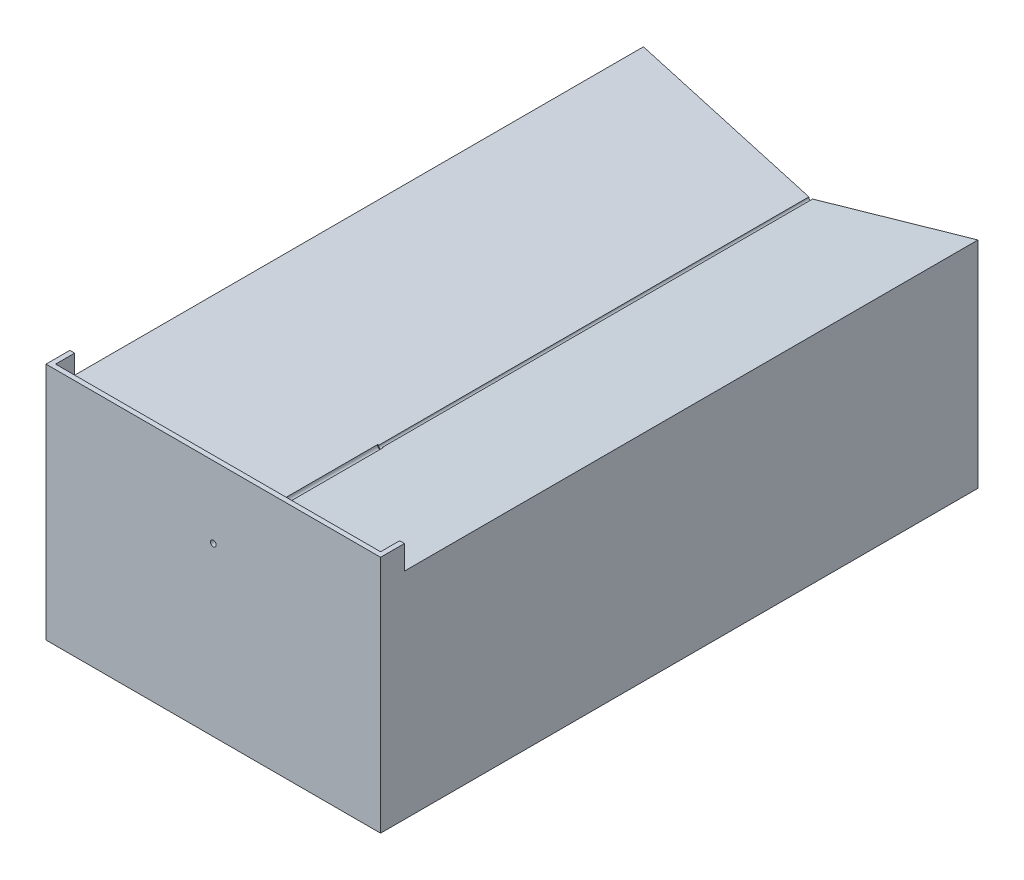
ISO-10303-21;
HEADER;
FILE_DESCRIPTION(('STEP AP214'),'2;1');
FILE_NAME('part.step','',(''),(''),'','','');
FILE_SCHEMA(('AUTOMOTIVE_DESIGN { 1 0 10303 214 1 1 1 1 }'));
ENDSEC;
DATA;
#1=APPLICATION_CONTEXT('core data for automotive mechanical design processes');
#2=APPLICATION_PROTOCOL_DEFINITION('international standard','automotive_design',2000,#1);
#3=PRODUCT_CONTEXT('',#1,'mechanical');
#4=PRODUCT('Part','Part','',(#3));
#5=PRODUCT_RELATED_PRODUCT_CATEGORY('part','',(#4));
#6=PRODUCT_DEFINITION_FORMATION('','',#4);
#7=PRODUCT_DEFINITION_CONTEXT('part definition',#1,'design');
#8=PRODUCT_DEFINITION('design','',#6,#7);
#9=PRODUCT_DEFINITION_SHAPE('','',#8);
#10=(LENGTH_UNIT() NAMED_UNIT(*) SI_UNIT(.MILLI.,.METRE.));
#11=(NAMED_UNIT(*) PLANE_ANGLE_UNIT() SI_UNIT($,.RADIAN.));
#12=(NAMED_UNIT(*) SI_UNIT($,.STERADIAN.) SOLID_ANGLE_UNIT());
#13=UNCERTAINTY_MEASURE_WITH_UNIT(LENGTH_MEASURE(1.E-05),#10,'distance_accuracy_value','');
#14=(GEOMETRIC_REPRESENTATION_CONTEXT(3) GLOBAL_UNCERTAINTY_ASSIGNED_CONTEXT((#13)) GLOBAL_UNIT_ASSIGNED_CONTEXT((#10,
#11,#12)) REPRESENTATION_CONTEXT('',''));
#15=CARTESIAN_POINT('',(0.,0.,0.));
#16=DIRECTION('',(0.,0.,1.));
#17=DIRECTION('',(1.,0.,0.));
#18=AXIS2_PLACEMENT_3D('',#15,#16,#17);
#19=CARTESIAN_POINT('',(0.,12.5,120.));
#20=DIRECTION('',(0.,0.,-1.));
#21=DIRECTION('',(-1.,0.,0.));
#22=AXIS2_PLACEMENT_3D('',#19,#20,#21);
#23=CYLINDRICAL_SURFACE('',#22,0.399999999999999);
#24=CARTESIAN_POINT('',(0.,12.5,90.));
#25=DIRECTION('',(0.,0.,1.));
#26=DIRECTION('',(1.,0.,0.));
#27=AXIS2_PLACEMENT_3D('',#24,#25,#26);
#28=CIRCLE('',#27,0.399999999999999);
#29=CARTESIAN_POINT('',(0.384609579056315,12.6098884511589,90.));
#30=VERTEX_POINT('',#29);
#31=CARTESIAN_POINT('',(-0.384609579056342,12.6098884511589,90.));
#32=VERTEX_POINT('',#31);
#33=EDGE_CURVE('E11',#30,#32,#28,.F.);
#34=ORIENTED_EDGE('',*,*,#33,.F.);
#35=DIRECTION('',(0.,0.,-1.));
#36=VECTOR('',#35,1.);
#37=CARTESIAN_POINT('',(0.384609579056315,12.6098884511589,120.));
#38=LINE('',#37,#36);
#39=CARTESIAN_POINT('',(0.384609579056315,12.6098884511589,0.));
#40=VERTEX_POINT('',#39);
#41=EDGE_CURVE('E159',#30,#40,#38,.T.);
#42=ORIENTED_EDGE('',*,*,#41,.T.);
#43=CARTESIAN_POINT('',(0.,12.5,0.));
#44=DIRECTION('',(0.,0.,-1.));
#45=DIRECTION('',(1.,0.,0.));
#46=AXIS2_PLACEMENT_3D('',#43,#44,#45);
#47=CIRCLE('',#46,0.399999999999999);
#48=CARTESIAN_POINT('',(-0.384609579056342,12.6098884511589,0.));
#49=VERTEX_POINT('',#48);
#50=EDGE_CURVE('E239',#40,#49,#47,.T.);
#51=ORIENTED_EDGE('',*,*,#50,.T.);
#52=DIRECTION('',(0.,0.,-1.));
#53=VECTOR('',#52,1.);
#54=CARTESIAN_POINT('',(-0.384609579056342,12.6098884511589,120.));
#55=LINE('',#54,#53);
#56=EDGE_CURVE('E228',#32,#49,#55,.T.);
#57=ORIENTED_EDGE('',*,*,#56,.F.);
#58=EDGE_LOOP('',(#34,#42,#51,#57));
#59=FACE_BOUND('',#58,.T.);
#60=ADVANCED_FACE('F33',(#59),#23,.F.);
#61=CARTESIAN_POINT('',(0.,0.,120.));
#62=DIRECTION('',(0.,0.,-1.));
#63=DIRECTION('',(-1.,0.,0.));
#64=AXIS2_PLACEMENT_3D('',#61,#62,#63);
#65=PLANE('',#64);
#66=DIRECTION('',(0.,1.,0.));
#67=VECTOR('',#66,1.);
#68=CARTESIAN_POINT('',(-34.,-20.5,120.));
#69=LINE('',#68,#67);
#70=CARTESIAN_POINT('',(-34.,22.2142857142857,120.));
#71=VERTEX_POINT('',#70);
#72=CARTESIAN_POINT('',(-34.,27.5,120.));
#73=VERTEX_POINT('',#72);
#74=EDGE_CURVE('E187',#71,#73,#69,.T.);
#75=ORIENTED_EDGE('',*,*,#74,.F.);
#76=DIRECTION('',(-0.961523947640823,0.274721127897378,0.));
#77=VECTOR('',#76,1.);
#78=CARTESIAN_POINT('',(-35.,22.5,120.));
#79=LINE('',#78,#77);
#80=CARTESIAN_POINT('',(-35.,22.5,120.));
#81=VERTEX_POINT('',#80);
#82=EDGE_CURVE('E225',#71,#81,#79,.T.);
#83=ORIENTED_EDGE('',*,*,#82,.T.);
#84=DIRECTION('',(0.,-1.,0.));
#85=VECTOR('',#84,1.);
#86=CARTESIAN_POINT('',(-35.,-22.5,120.));
#87=LINE('',#86,#85);
#88=CARTESIAN_POINT('',(-35.,27.5,120.));
#89=VERTEX_POINT('',#88);
#90=EDGE_CURVE('E196',#89,#81,#87,.T.);
#91=ORIENTED_EDGE('',*,*,#90,.F.);
#92=DIRECTION('',(-1.,0.,0.));
#93=VECTOR('',#92,1.);
#94=CARTESIAN_POINT('',(-35.,27.5,120.));
#95=LINE('',#94,#93);
#96=EDGE_CURVE('E213',#73,#89,#95,.T.);
#97=ORIENTED_EDGE('',*,*,#96,.F.);
#98=EDGE_LOOP('',(#75,#83,#91,#97));
#99=FACE_BOUND('',#98,.T.);
#100=ADVANCED_FACE('F316',(#99),#65,.T.);
#101=CARTESIAN_POINT('',(-35.,22.5,120.));
#102=DIRECTION('',(-0.274721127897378,-0.961523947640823,0.));
#103=DIRECTION('',(0.961523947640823,-0.274721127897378,0.));
#104=AXIS2_PLACEMENT_3D('',#101,#102,#103);
#105=PLANE('',#104);
#106=CARTESIAN_POINT('',(-0.576914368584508,12.6648326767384,120.));
#107=VERTEX_POINT('',#106);
#108=EDGE_CURVE('E222',#107,#71,#79,.T.);
#109=ORIENTED_EDGE('',*,*,#108,.F.);
#110=DIRECTION('',(0.,0.,1.));
#111=VECTOR('',#110,1.);
#112=CARTESIAN_POINT('',(-0.576914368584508,12.6648326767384,90.));
#113=LINE('',#112,#111);
#114=CARTESIAN_POINT('',(-0.576914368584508,12.6648326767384,90.));
#115=VERTEX_POINT('',#114);
#116=EDGE_CURVE('E48',#107,#115,#113,.F.);
#117=ORIENTED_EDGE('',*,*,#116,.T.);
#118=DIRECTION('',(-0.961523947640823,0.274721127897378,0.));
#119=VECTOR('',#118,1.);
#120=CARTESIAN_POINT('',(-35.,22.5,90.));
#121=LINE('',#120,#119);
#122=EDGE_CURVE('E152',#32,#115,#121,.T.);
#123=ORIENTED_EDGE('',*,*,#122,.F.);
#124=ORIENTED_EDGE('',*,*,#56,.T.);
#125=DIRECTION('',(-0.961523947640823,0.274721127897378,0.));
#126=VECTOR('',#125,1.);
#127=CARTESIAN_POINT('',(-35.,22.5,0.));
#128=LINE('',#127,#126);
#129=CARTESIAN_POINT('',(-35.,22.5,0.));
#130=VERTEX_POINT('',#129);
#131=EDGE_CURVE('E221',#49,#130,#128,.T.);
#132=ORIENTED_EDGE('',*,*,#131,.T.);
#133=DIRECTION('',(0.,0.,-1.));
#134=VECTOR('',#133,1.);
#135=CARTESIAN_POINT('',(-35.,22.5,120.));
#136=LINE('',#135,#134);
#137=EDGE_CURVE('E41',#81,#130,#136,.T.);
#138=ORIENTED_EDGE('',*,*,#137,.F.);
#139=ORIENTED_EDGE('',*,*,#82,.F.);
#140=EDGE_LOOP('',(#109,#117,#123,#124,#132,#138,#139));
#141=FACE_BOUND('',#140,.T.);
#142=ADVANCED_FACE('F35',(#141),#105,.F.);
#143=CARTESIAN_POINT('',(-35.,-22.5,120.));
#144=DIRECTION('',(1.,0.,0.));
#145=DIRECTION('',(0.,0.,-1.));
#146=AXIS2_PLACEMENT_3D('',#143,#144,#145);
#147=PLANE('',#146);
#148=DIRECTION('',(0.,-1.,0.));
#149=VECTOR('',#148,1.);
#150=CARTESIAN_POINT('',(-35.,-22.5,0.));
#151=LINE('',#150,#149);
#152=CARTESIAN_POINT('',(-35.,-22.5,0.));
#153=VERTEX_POINT('',#152);
#154=EDGE_CURVE('E231',#130,#153,#151,.T.);
#155=ORIENTED_EDGE('',*,*,#154,.T.);
#156=DIRECTION('',(0.,0.,-1.));
#157=VECTOR('',#156,1.);
#158=CARTESIAN_POINT('',(-35.,-22.5,120.));
#159=LINE('',#158,#157);
#160=CARTESIAN_POINT('',(-35.,-22.5,125.));
#161=VERTEX_POINT('',#160);
#162=EDGE_CURVE('E250',#161,#153,#159,.T.);
#163=ORIENTED_EDGE('',*,*,#162,.F.);
#164=DIRECTION('',(0.,-1.,0.));
#165=VECTOR('',#164,1.);
#166=CARTESIAN_POINT('',(-35.,-22.5,125.));
#167=LINE('',#166,#165);
#168=CARTESIAN_POINT('',(-35.,27.5,125.));
#169=VERTEX_POINT('',#168);
#170=EDGE_CURVE('E197',#169,#161,#167,.T.);
#171=ORIENTED_EDGE('',*,*,#170,.F.);
#172=DIRECTION('',(0.,0.,-1.));
#173=VECTOR('',#172,1.);
#174=CARTESIAN_POINT('',(-35.,27.5,125.));
#175=LINE('',#174,#173);
#176=EDGE_CURVE('E208',#169,#89,#175,.T.);
#177=ORIENTED_EDGE('',*,*,#176,.T.);
#178=ORIENTED_EDGE('',*,*,#90,.T.);
#179=ORIENTED_EDGE('',*,*,#137,.T.);
#180=EDGE_LOOP('',(#155,#163,#171,#177,#178,#179));
#181=FACE_BOUND('',#180,.T.);
#182=ADVANCED_FACE('F279',(#181),#147,.F.);
#183=CARTESIAN_POINT('',(35.,-22.5,120.));
#184=DIRECTION('',(0.,1.,0.));
#185=DIRECTION('',(-1.,0.,0.));
#186=AXIS2_PLACEMENT_3D('',#183,#184,#185);
#187=PLANE('',#186);
#188=DIRECTION('',(1.,0.,0.));
#189=VECTOR('',#188,1.);
#190=CARTESIAN_POINT('',(35.,-22.5,0.));
#191=LINE('',#190,#189);
#192=CARTESIAN_POINT('',(35.,-22.5,0.));
#193=VERTEX_POINT('',#192);
#194=EDGE_CURVE('E233',#153,#193,#191,.T.);
#195=ORIENTED_EDGE('',*,*,#194,.T.);
#196=DIRECTION('',(0.,0.,-1.));
#197=VECTOR('',#196,1.);
#198=CARTESIAN_POINT('',(35.,-22.5,120.));
#199=LINE('',#198,#197);
#200=CARTESIAN_POINT('',(35.,-22.5,125.));
#201=VERTEX_POINT('',#200);
#202=EDGE_CURVE('E247',#201,#193,#199,.T.);
#203=ORIENTED_EDGE('',*,*,#202,.F.);
#204=DIRECTION('',(1.,0.,0.));
#205=VECTOR('',#204,1.);
#206=CARTESIAN_POINT('',(-35.,-22.5,125.));
#207=LINE('',#206,#205);
#208=EDGE_CURVE('E200',#161,#201,#207,.T.);
#209=ORIENTED_EDGE('',*,*,#208,.F.);
#210=ORIENTED_EDGE('',*,*,#162,.T.);
#211=EDGE_LOOP('',(#195,#203,#209,#210));
#212=FACE_BOUND('',#211,.T.);
#213=ADVANCED_FACE('F283',(#212),#187,.F.);
#214=CARTESIAN_POINT('',(35.,-22.5,120.));
#215=DIRECTION('',(-1.,0.,0.));
#216=DIRECTION('',(0.,0.,1.));
#217=AXIS2_PLACEMENT_3D('',#214,#215,#216);
#218=PLANE('',#217);
#219=DIRECTION('',(0.,1.,0.));
#220=VECTOR('',#219,1.);
#221=CARTESIAN_POINT('',(35.,-22.5,0.));
#222=LINE('',#221,#220);
#223=CARTESIAN_POINT('',(35.,22.5,0.));
#224=VERTEX_POINT('',#223);
#225=EDGE_CURVE('E235',#193,#224,#222,.T.);
#226=ORIENTED_EDGE('',*,*,#225,.T.);
#227=DIRECTION('',(0.,0.,-1.));
#228=VECTOR('',#227,1.);
#229=CARTESIAN_POINT('',(35.,22.5,120.));
#230=LINE('',#229,#228);
#231=CARTESIAN_POINT('',(35.,22.5,120.));
#232=VERTEX_POINT('',#231);
#233=EDGE_CURVE('E244',#232,#224,#230,.T.);
#234=ORIENTED_EDGE('',*,*,#233,.F.);
#235=DIRECTION('',(0.,1.,0.));
#236=VECTOR('',#235,1.);
#237=CARTESIAN_POINT('',(35.,-22.5,120.));
#238=LINE('',#237,#236);
#239=CARTESIAN_POINT('',(35.,27.5,120.));
#240=VERTEX_POINT('',#239);
#241=EDGE_CURVE('E211',#232,#240,#238,.T.);
#242=ORIENTED_EDGE('',*,*,#241,.T.);
#243=DIRECTION('',(0.,0.,-1.));
#244=VECTOR('',#243,1.);
#245=CARTESIAN_POINT('',(35.,27.5,125.));
#246=LINE('',#245,#244);
#247=CARTESIAN_POINT('',(35.,27.5,125.));
#248=VERTEX_POINT('',#247);
#249=EDGE_CURVE('E218',#248,#240,#246,.T.);
#250=ORIENTED_EDGE('',*,*,#249,.F.);
#251=DIRECTION('',(0.,1.,0.));
#252=VECTOR('',#251,1.);
#253=CARTESIAN_POINT('',(35.,-22.5,125.));
#254=LINE('',#253,#252);
#255=EDGE_CURVE('E204',#201,#248,#254,.T.);
#256=ORIENTED_EDGE('',*,*,#255,.F.);
#257=ORIENTED_EDGE('',*,*,#202,.T.);
#258=EDGE_LOOP('',(#226,#234,#242,#250,#256,#257));
#259=FACE_BOUND('',#258,.T.);
#260=ADVANCED_FACE('F286',(#259),#218,.F.);
#261=CARTESIAN_POINT('',(0.384609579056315,12.6098884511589,120.));
#262=DIRECTION('',(0.274721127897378,-0.961523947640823,0.));
#263=DIRECTION('',(0.961523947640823,0.274721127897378,0.));
#264=AXIS2_PLACEMENT_3D('',#261,#262,#263);
#265=PLANE('',#264);
#266=DIRECTION('',(-0.961523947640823,-0.274721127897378,0.));
#267=VECTOR('',#266,1.);
#268=CARTESIAN_POINT('',(0.384609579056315,12.6098884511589,90.));
#269=LINE('',#268,#267);
#270=CARTESIAN_POINT('',(0.57691436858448,12.6648326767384,90.));
#271=VERTEX_POINT('',#270);
#272=EDGE_CURVE('E149',#271,#30,#269,.T.);
#273=ORIENTED_EDGE('',*,*,#272,.F.);
#274=DIRECTION('',(0.,0.,1.));
#275=VECTOR('',#274,1.);
#276=CARTESIAN_POINT('',(0.57691436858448,12.6648326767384,90.));
#277=LINE('',#276,#275);
#278=CARTESIAN_POINT('',(0.57691436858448,12.6648326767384,120.));
#279=VERTEX_POINT('',#278);
#280=EDGE_CURVE('E138',#271,#279,#277,.T.);
#281=ORIENTED_EDGE('',*,*,#280,.T.);
#282=DIRECTION('',(0.961523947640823,0.274721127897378,0.));
#283=VECTOR('',#282,1.);
#284=CARTESIAN_POINT('',(0.384609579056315,12.6098884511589,120.));
#285=LINE('',#284,#283);
#286=CARTESIAN_POINT('',(34.,22.2142857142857,120.));
#287=VERTEX_POINT('',#286);
#288=EDGE_CURVE('E186',#279,#287,#285,.T.);
#289=ORIENTED_EDGE('',*,*,#288,.T.);
#290=DIRECTION('',(-0.961523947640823,-0.274721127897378,0.));
#291=VECTOR('',#290,1.);
#292=CARTESIAN_POINT('',(0.384609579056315,12.6098884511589,120.));
#293=LINE('',#292,#291);
#294=EDGE_CURVE('E224',#232,#287,#293,.T.);
#295=ORIENTED_EDGE('',*,*,#294,.F.);
#296=ORIENTED_EDGE('',*,*,#233,.T.);
#297=DIRECTION('',(-0.961523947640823,-0.274721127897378,0.));
#298=VECTOR('',#297,1.);
#299=CARTESIAN_POINT('',(0.384609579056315,12.6098884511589,0.));
#300=LINE('',#299,#298);
#301=EDGE_CURVE('E237',#224,#40,#300,.T.);
#302=ORIENTED_EDGE('',*,*,#301,.T.);
#303=ORIENTED_EDGE('',*,*,#41,.F.);
#304=EDGE_LOOP('',(#273,#281,#289,#295,#296,#302,#303));
#305=FACE_BOUND('',#304,.T.);
#306=ADVANCED_FACE('F157',(#305),#265,.F.);
#307=CARTESIAN_POINT('',(0.,12.5,0.));
#308=DIRECTION('',(0.,0.,1.));
#309=DIRECTION('',(1.,0.,0.));
#310=AXIS2_PLACEMENT_3D('',#307,#308,#309);
#311=PLANE('',#310);
#312=ORIENTED_EDGE('',*,*,#131,.F.);
#313=ORIENTED_EDGE('',*,*,#50,.F.);
#314=ORIENTED_EDGE('',*,*,#301,.F.);
#315=ORIENTED_EDGE('',*,*,#225,.F.);
#316=ORIENTED_EDGE('',*,*,#194,.F.);
#317=ORIENTED_EDGE('',*,*,#154,.F.);
#318=EDGE_LOOP('',(#312,#313,#314,#315,#316,#317));
#319=FACE_BOUND('',#318,.T.);
#320=ADVANCED_FACE('F291',(#319),#311,.F.);
#321=DIRECTION('',(0.,1.,0.));
#322=VECTOR('',#321,1.);
#323=CARTESIAN_POINT('',(34.,-20.5,120.));
#324=LINE('',#323,#322);
#325=CARTESIAN_POINT('',(34.,27.5,120.));
#326=VERTEX_POINT('',#325);
#327=EDGE_CURVE('E191',#287,#326,#324,.T.);
#328=ORIENTED_EDGE('',*,*,#327,.T.);
#329=EDGE_CURVE('E201',#240,#326,#95,.T.);
#330=ORIENTED_EDGE('',*,*,#329,.F.);
#331=ORIENTED_EDGE('',*,*,#241,.F.);
#332=ORIENTED_EDGE('',*,*,#294,.T.);
#333=EDGE_LOOP('',(#328,#330,#331,#332));
#334=FACE_BOUND('',#333,.T.);
#335=ADVANCED_FACE('F301',(#334),#65,.T.);
#336=CARTESIAN_POINT('',(-35.,27.5,125.));
#337=DIRECTION('',(0.,-1.,0.));
#338=DIRECTION('',(0.,0.,-1.));
#339=AXIS2_PLACEMENT_3D('',#336,#337,#338);
#340=PLANE('',#339);
#341=DIRECTION('',(1.,0.,0.));
#342=VECTOR('',#341,1.);
#343=CARTESIAN_POINT('',(34.,27.5,124.));
#344=LINE('',#343,#342);
#345=CARTESIAN_POINT('',(-34.,27.5,124.));
#346=VERTEX_POINT('',#345);
#347=CARTESIAN_POINT('',(34.,27.5,124.));
#348=VERTEX_POINT('',#347);
#349=EDGE_CURVE('E179',#346,#348,#344,.T.);
#350=ORIENTED_EDGE('',*,*,#349,.F.);
#351=DIRECTION('',(0.,0.,1.));
#352=VECTOR('',#351,1.);
#353=CARTESIAN_POINT('',(-34.,27.5,124.));
#354=LINE('',#353,#352);
#355=EDGE_CURVE('E56',#73,#346,#354,.T.);
#356=ORIENTED_EDGE('',*,*,#355,.F.);
#357=ORIENTED_EDGE('',*,*,#96,.T.);
#358=ORIENTED_EDGE('',*,*,#176,.F.);
#359=DIRECTION('',(-1.,0.,0.));
#360=VECTOR('',#359,1.);
#361=CARTESIAN_POINT('',(-35.,27.5,125.));
#362=LINE('',#361,#360);
#363=EDGE_CURVE('E206',#248,#169,#362,.T.);
#364=ORIENTED_EDGE('',*,*,#363,.F.);
#365=ORIENTED_EDGE('',*,*,#249,.T.);
#366=ORIENTED_EDGE('',*,*,#329,.T.);
#367=DIRECTION('',(0.,0.,-1.));
#368=VECTOR('',#367,1.);
#369=CARTESIAN_POINT('',(34.,27.5,124.));
#370=LINE('',#369,#368);
#371=EDGE_CURVE('E168',#348,#326,#370,.T.);
#372=ORIENTED_EDGE('',*,*,#371,.F.);
#373=EDGE_LOOP('',(#350,#356,#357,#358,#364,#365,#366,#372));
#374=FACE_BOUND('',#373,.T.);
#375=ADVANCED_FACE('F271',(#374),#340,.F.);
#376=CARTESIAN_POINT('',(0.,0.,125.));
#377=DIRECTION('',(0.,0.,-1.));
#378=DIRECTION('',(-1.,0.,0.));
#379=AXIS2_PLACEMENT_3D('',#376,#377,#378);
#380=PLANE('',#379);
#381=CARTESIAN_POINT('',(0.,12.5,125.));
#382=DIRECTION('',(0.,0.,1.));
#383=DIRECTION('',(1.,0.,0.));
#384=AXIS2_PLACEMENT_3D('',#381,#382,#383);
#385=CIRCLE('',#384,0.6);
#386=CARTESIAN_POINT('',(0.599999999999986,12.5,125.));
#387=VERTEX_POINT('',#386);
#388=EDGE_CURVE('E154',#387,#387,#385,.T.);
#389=ORIENTED_EDGE('',*,*,#388,.F.);
#390=EDGE_LOOP('',(#389));
#391=FACE_BOUND('',#390,.T.);
#392=ORIENTED_EDGE('',*,*,#170,.T.);
#393=ORIENTED_EDGE('',*,*,#208,.T.);
#394=ORIENTED_EDGE('',*,*,#255,.T.);
#395=ORIENTED_EDGE('',*,*,#363,.T.);
#396=EDGE_LOOP('',(#392,#393,#394,#395));
#397=FACE_BOUND('',#396,.T.);
#398=ADVANCED_FACE('F267',(#391,#397),#380,.F.);
#399=CARTESIAN_POINT('',(-34.,-20.5,120.));
#400=DIRECTION('',(0.,0.,-1.));
#401=DIRECTION('',(-1.,0.,0.));
#402=AXIS2_PLACEMENT_3D('',#399,#400,#401);
#403=PLANE('',#402);
#404=ORIENTED_EDGE('',*,*,#288,.F.);
#405=CARTESIAN_POINT('',(0.,12.5,120.));
#406=DIRECTION('',(0.,0.,-1.));
#407=DIRECTION('',(-1.,0.,0.));
#408=AXIS2_PLACEMENT_3D('',#405,#406,#407);
#409=CIRCLE('',#408,0.6);
#410=EDGE_CURVE('E142',#279,#107,#409,.T.);
#411=ORIENTED_EDGE('',*,*,#410,.T.);
#412=ORIENTED_EDGE('',*,*,#108,.T.);
#413=CARTESIAN_POINT('',(-34.,-20.5,120.));
#414=VERTEX_POINT('',#413);
#415=EDGE_CURVE('E183',#414,#71,#69,.T.);
#416=ORIENTED_EDGE('',*,*,#415,.F.);
#417=DIRECTION('',(-1.,0.,0.));
#418=VECTOR('',#417,1.);
#419=CARTESIAN_POINT('',(-34.,-20.5,120.));
#420=LINE('',#419,#418);
#421=CARTESIAN_POINT('',(34.,-20.5,120.));
#422=VERTEX_POINT('',#421);
#423=EDGE_CURVE('E174',#422,#414,#420,.T.);
#424=ORIENTED_EDGE('',*,*,#423,.F.);
#425=EDGE_CURVE('E188',#422,#287,#324,.T.);
#426=ORIENTED_EDGE('',*,*,#425,.T.);
#427=EDGE_LOOP('',(#404,#411,#412,#416,#424,#426));
#428=FACE_BOUND('',#427,.T.);
#429=ADVANCED_FACE('F270',(#428),#403,.F.);
#430=CARTESIAN_POINT('',(-34.,-20.5,124.));
#431=DIRECTION('',(-1.,0.,0.));
#432=DIRECTION('',(0.,0.,1.));
#433=AXIS2_PLACEMENT_3D('',#430,#431,#432);
#434=PLANE('',#433);
#435=ORIENTED_EDGE('',*,*,#355,.T.);
#436=DIRECTION('',(0.,1.,0.));
#437=VECTOR('',#436,1.);
#438=CARTESIAN_POINT('',(-34.,-20.5,124.));
#439=LINE('',#438,#437);
#440=CARTESIAN_POINT('',(-34.,-20.5,124.));
#441=VERTEX_POINT('',#440);
#442=EDGE_CURVE('E177',#441,#346,#439,.T.);
#443=ORIENTED_EDGE('',*,*,#442,.F.);
#444=DIRECTION('',(0.,0.,1.));
#445=VECTOR('',#444,1.);
#446=CARTESIAN_POINT('',(-34.,-20.5,124.));
#447=LINE('',#446,#445);
#448=EDGE_CURVE('E164',#414,#441,#447,.T.);
#449=ORIENTED_EDGE('',*,*,#448,.F.);
#450=ORIENTED_EDGE('',*,*,#415,.T.);
#451=ORIENTED_EDGE('',*,*,#74,.T.);
#452=EDGE_LOOP('',(#435,#443,#449,#450,#451));
#453=FACE_BOUND('',#452,.T.);
#454=ADVANCED_FACE('F373',(#453),#434,.F.);
#455=CARTESIAN_POINT('',(34.,-20.5,124.));
#456=DIRECTION('',(1.,0.,0.));
#457=DIRECTION('',(0.,0.,-1.));
#458=AXIS2_PLACEMENT_3D('',#455,#456,#457);
#459=PLANE('',#458);
#460=ORIENTED_EDGE('',*,*,#371,.T.);
#461=ORIENTED_EDGE('',*,*,#327,.F.);
#462=ORIENTED_EDGE('',*,*,#425,.F.);
#463=DIRECTION('',(0.,0.,-1.));
#464=VECTOR('',#463,1.);
#465=CARTESIAN_POINT('',(34.,-20.5,124.));
#466=LINE('',#465,#464);
#467=CARTESIAN_POINT('',(34.,-20.5,124.));
#468=VERTEX_POINT('',#467);
#469=EDGE_CURVE('E171',#468,#422,#466,.T.);
#470=ORIENTED_EDGE('',*,*,#469,.F.);
#471=DIRECTION('',(0.,1.,0.));
#472=VECTOR('',#471,1.);
#473=CARTESIAN_POINT('',(34.,-20.5,124.));
#474=LINE('',#473,#472);
#475=EDGE_CURVE('E192',#468,#348,#474,.T.);
#476=ORIENTED_EDGE('',*,*,#475,.T.);
#477=EDGE_LOOP('',(#460,#461,#462,#470,#476));
#478=FACE_BOUND('',#477,.T.);
#479=ADVANCED_FACE('F304',(#478),#459,.F.);
#480=CARTESIAN_POINT('',(34.,-20.5,124.));
#481=DIRECTION('',(0.,0.,1.));
#482=DIRECTION('',(1.,0.,0.));
#483=AXIS2_PLACEMENT_3D('',#480,#481,#482);
#484=PLANE('',#483);
#485=CARTESIAN_POINT('',(0.,12.5,124.));
#486=DIRECTION('',(0.,0.,1.));
#487=DIRECTION('',(1.,0.,0.));
#488=AXIS2_PLACEMENT_3D('',#485,#486,#487);
#489=CIRCLE('',#488,0.6);
#490=CARTESIAN_POINT('',(0.599999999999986,12.5,124.));
#491=VERTEX_POINT('',#490);
#492=EDGE_CURVE('E153',#491,#491,#489,.T.);
#493=ORIENTED_EDGE('',*,*,#492,.T.);
#494=EDGE_LOOP('',(#493));
#495=FACE_BOUND('',#494,.T.);
#496=ORIENTED_EDGE('',*,*,#349,.T.);
#497=ORIENTED_EDGE('',*,*,#475,.F.);
#498=DIRECTION('',(1.,0.,0.));
#499=VECTOR('',#498,1.);
#500=CARTESIAN_POINT('',(34.,-20.5,124.));
#501=LINE('',#500,#499);
#502=EDGE_CURVE('E167',#441,#468,#501,.T.);
#503=ORIENTED_EDGE('',*,*,#502,.F.);
#504=ORIENTED_EDGE('',*,*,#442,.T.);
#505=EDGE_LOOP('',(#496,#497,#503,#504));
#506=FACE_BOUND('',#505,.T.);
#507=ADVANCED_FACE('F312',(#495,#506),#484,.F.);
#508=CARTESIAN_POINT('',(0.,-20.5,0.));
#509=DIRECTION('',(0.,-1.,0.));
#510=DIRECTION('',(0.,0.,-1.));
#511=AXIS2_PLACEMENT_3D('',#508,#509,#510);
#512=PLANE('',#511);
#513=ORIENTED_EDGE('',*,*,#448,.T.);
#514=ORIENTED_EDGE('',*,*,#502,.T.);
#515=ORIENTED_EDGE('',*,*,#469,.T.);
#516=ORIENTED_EDGE('',*,*,#423,.T.);
#517=EDGE_LOOP('',(#513,#514,#515,#516));
#518=FACE_BOUND('',#517,.T.);
#519=ADVANCED_FACE('F309',(#518),#512,.F.);
#520=CARTESIAN_POINT('',(0.,12.5,90.));
#521=DIRECTION('',(0.,0.,1.));
#522=DIRECTION('',(1.,0.,0.));
#523=AXIS2_PLACEMENT_3D('',#520,#521,#522);
#524=CYLINDRICAL_SURFACE('',#523,0.6);
#525=ORIENTED_EDGE('',*,*,#388,.T.);
#526=EDGE_LOOP('',(#525));
#527=FACE_BOUND('',#526,.T.);
#528=ORIENTED_EDGE('',*,*,#492,.F.);
#529=EDGE_LOOP('',(#528));
#530=FACE_BOUND('',#529,.T.);
#531=ADVANCED_FACE('F264',(#527,#530),#524,.F.);
#532=CARTESIAN_POINT('',(0.,12.5,90.));
#533=DIRECTION('',(0.,0.,1.));
#534=DIRECTION('',(1.,0.,0.));
#535=AXIS2_PLACEMENT_3D('',#532,#533,#534);
#536=PLANE('',#535);
#537=ORIENTED_EDGE('',*,*,#122,.T.);
#538=CARTESIAN_POINT('',(0.,12.5,90.));
#539=DIRECTION('',(0.,0.,1.));
#540=DIRECTION('',(1.,0.,0.));
#541=AXIS2_PLACEMENT_3D('',#538,#539,#540);
#542=CIRCLE('',#541,0.6);
#543=EDGE_CURVE('E141',#115,#271,#542,.T.);
#544=ORIENTED_EDGE('',*,*,#543,.T.);
#545=ORIENTED_EDGE('',*,*,#272,.T.);
#546=ORIENTED_EDGE('',*,*,#33,.T.);
#547=EDGE_LOOP('',(#537,#544,#545,#546));
#548=FACE_BOUND('',#547,.T.);
#549=ADVANCED_FACE('F148',(#548),#536,.T.);
#550=ORIENTED_EDGE('',*,*,#410,.F.);
#551=ORIENTED_EDGE('',*,*,#280,.F.);
#552=ORIENTED_EDGE('',*,*,#543,.F.);
#553=ORIENTED_EDGE('',*,*,#116,.F.);
#554=EDGE_LOOP('',(#550,#551,#552,#553));
#555=FACE_BOUND('',#554,.T.);
#556=ADVANCED_FACE('F140',(#555),#524,.F.);
#557=CLOSED_SHELL('',(#60,#100,#142,#182,#213,#260,#306,#320,#335,#375,#398,#429,#454,#479,#507,
#519,#531,#549,#556));
#558=MANIFOLD_SOLID_BREP('B2',#557);
#559=ADVANCED_BREP_SHAPE_REPRESENTATION('',(#18,#558),#14);
#560=SHAPE_DEFINITION_REPRESENTATION(#9,#559);
ENDSEC;
END-ISO-10303-21;
